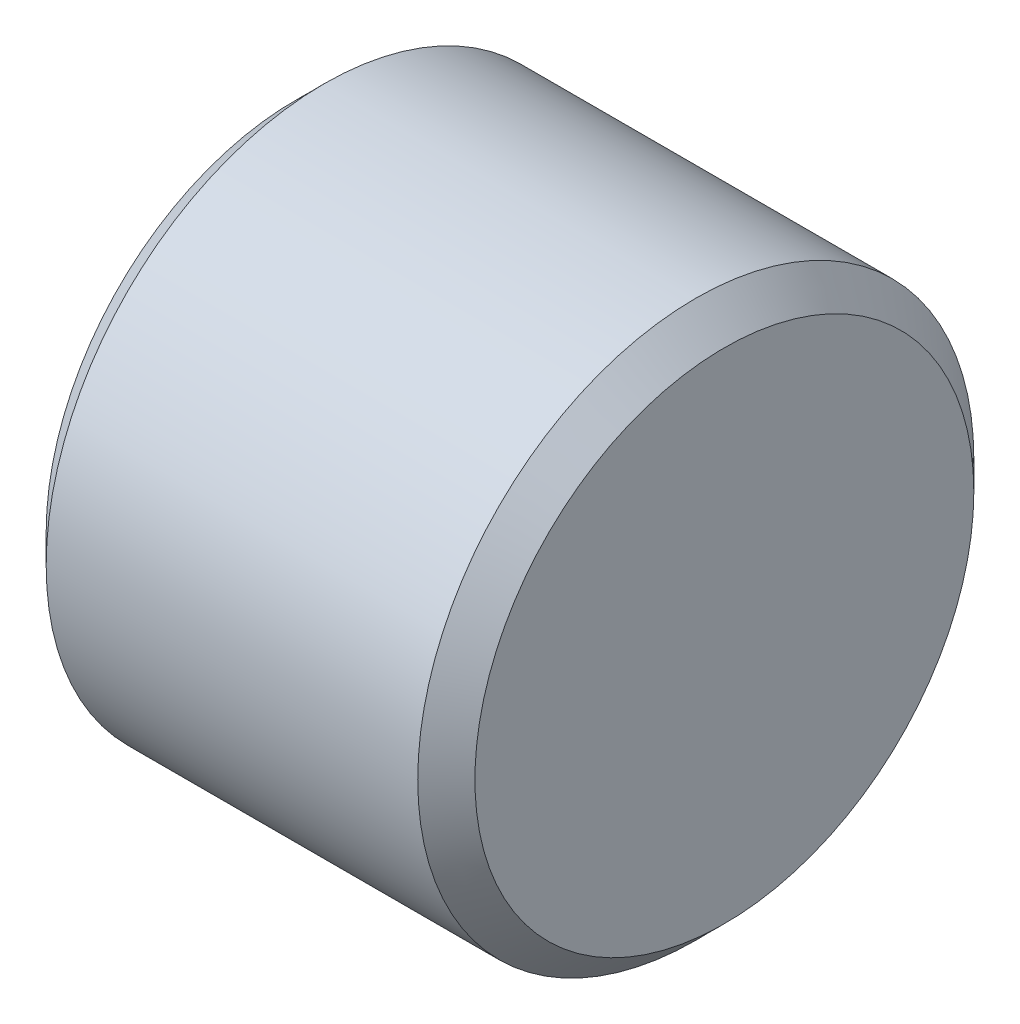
ISO-10303-21;
HEADER;
FILE_DESCRIPTION(('STEP AP214'),'2;1');
FILE_NAME('part.step','',(''),(''),'','','');
FILE_SCHEMA(('AUTOMOTIVE_DESIGN { 1 0 10303 214 1 1 1 1 }'));
ENDSEC;
DATA;
#1=APPLICATION_CONTEXT('core data for automotive mechanical design processes');
#2=APPLICATION_PROTOCOL_DEFINITION('international standard','automotive_design',2000,#1);
#3=PRODUCT_CONTEXT('',#1,'mechanical');
#4=PRODUCT('Part','Part','',(#3));
#5=PRODUCT_RELATED_PRODUCT_CATEGORY('part','',(#4));
#6=PRODUCT_DEFINITION_FORMATION('','',#4);
#7=PRODUCT_DEFINITION_CONTEXT('part definition',#1,'design');
#8=PRODUCT_DEFINITION('design','',#6,#7);
#9=PRODUCT_DEFINITION_SHAPE('','',#8);
#10=(LENGTH_UNIT() NAMED_UNIT(*) SI_UNIT(.MILLI.,.METRE.));
#11=(NAMED_UNIT(*) PLANE_ANGLE_UNIT() SI_UNIT($,.RADIAN.));
#12=(NAMED_UNIT(*) SI_UNIT($,.STERADIAN.) SOLID_ANGLE_UNIT());
#13=UNCERTAINTY_MEASURE_WITH_UNIT(LENGTH_MEASURE(1.E-05),#10,'distance_accuracy_value','');
#14=(GEOMETRIC_REPRESENTATION_CONTEXT(3) GLOBAL_UNCERTAINTY_ASSIGNED_CONTEXT((#13)) GLOBAL_UNIT_ASSIGNED_CONTEXT((#10,
#11,#12)) REPRESENTATION_CONTEXT('',''));
#15=CARTESIAN_POINT('',(0.,0.,0.));
#16=DIRECTION('',(0.,0.,1.));
#17=DIRECTION('',(1.,0.,0.));
#18=AXIS2_PLACEMENT_3D('',#15,#16,#17);
#19=CARTESIAN_POINT('',(0.,0.,0.));
#20=DIRECTION('',(1.,0.,0.));
#21=DIRECTION('',(0.,0.,-1.));
#22=AXIS2_PLACEMENT_3D('',#19,#20,#21);
#23=PLANE('',#22);
#24=CARTESIAN_POINT('',(0.,0.,0.));
#25=DIRECTION('',(1.,0.,0.));
#26=DIRECTION('',(0.,0.,-1.));
#27=AXIS2_PLACEMENT_3D('',#24,#25,#26);
#28=CIRCLE('',#27,4.364);
#29=CARTESIAN_POINT('',(0.,0.,-4.364));
#30=VERTEX_POINT('',#29);
#31=EDGE_CURVE('E60',#30,#30,#28,.T.);
#32=ORIENTED_EDGE('',*,*,#31,.T.);
#33=EDGE_LOOP('',(#32));
#34=FACE_BOUND('',#33,.T.);
#35=ADVANCED_FACE('F41',(#34),#23,.T.);
#36=CARTESIAN_POINT('',(0.,0.,0.));
#37=DIRECTION('',(1.,0.,0.));
#38=DIRECTION('',(0.,0.,-1.));
#39=AXIS2_PLACEMENT_3D('',#36,#37,#38);
#40=CYLINDRICAL_SURFACE('',#39,4.864);
#41=CARTESIAN_POINT('',(-0.500000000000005,0.,0.));
#42=DIRECTION('',(1.,0.,0.));
#43=DIRECTION('',(0.,0.,-1.));
#44=AXIS2_PLACEMENT_3D('',#41,#42,#43);
#45=CIRCLE('',#44,4.864);
#46=CARTESIAN_POINT('',(-0.500000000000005,0.,-4.864));
#47=VERTEX_POINT('',#46);
#48=EDGE_CURVE('E47',#47,#47,#45,.F.);
#49=ORIENTED_EDGE('',*,*,#48,.T.);
#50=EDGE_LOOP('',(#49));
#51=FACE_BOUND('',#50,.T.);
#52=CARTESIAN_POINT('',(-6.99999999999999,0.,0.));
#53=DIRECTION('',(-1.,0.,0.));
#54=DIRECTION('',(0.,0.,1.));
#55=AXIS2_PLACEMENT_3D('',#52,#53,#54);
#56=CIRCLE('',#55,4.864);
#57=CARTESIAN_POINT('',(-6.99999999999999,0.,4.864));
#58=VERTEX_POINT('',#57);
#59=EDGE_CURVE('E52',#58,#58,#56,.F.);
#60=ORIENTED_EDGE('',*,*,#59,.T.);
#61=EDGE_LOOP('',(#60));
#62=FACE_BOUND('',#61,.T.);
#63=ADVANCED_FACE('F80',(#51,#62),#40,.T.);
#64=CARTESIAN_POINT('',(-7.5,0.,0.));
#65=DIRECTION('',(-1.,0.,0.));
#66=DIRECTION('',(0.,0.,1.));
#67=AXIS2_PLACEMENT_3D('',#64,#65,#66);
#68=PLANE('',#67);
#69=CARTESIAN_POINT('',(-7.5,0.,0.));
#70=DIRECTION('',(-1.,0.,0.));
#71=DIRECTION('',(0.,0.,1.));
#72=AXIS2_PLACEMENT_3D('',#69,#70,#71);
#73=CIRCLE('',#72,4.36399999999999);
#74=CARTESIAN_POINT('',(-7.5,0.,4.36399999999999));
#75=VERTEX_POINT('',#74);
#76=EDGE_CURVE('E10',#75,#75,#73,.T.);
#77=ORIENTED_EDGE('',*,*,#76,.T.);
#78=EDGE_LOOP('',(#77));
#79=FACE_BOUND('',#78,.T.);
#80=CARTESIAN_POINT('',(-7.5,0.,0.0692792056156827));
#81=DIRECTION('',(-1.,0.,0.));
#82=DIRECTION('',(0.,0.,1.));
#83=AXIS2_PLACEMENT_3D('',#80,#81,#82);
#84=CIRCLE('',#83,0.6);
#85=CARTESIAN_POINT('',(-7.5,0.,0.669279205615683));
#86=VERTEX_POINT('',#85);
#87=EDGE_CURVE('E62',#86,#86,#84,.T.);
#88=ORIENTED_EDGE('',*,*,#87,.F.);
#89=EDGE_LOOP('',(#88));
#90=FACE_BOUND('',#89,.T.);
#91=ADVANCED_FACE('F74',(#79,#90),#68,.T.);
#92=CARTESIAN_POINT('',(-5.5,0.,0.0692792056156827));
#93=DIRECTION('',(-1.,0.,0.));
#94=DIRECTION('',(0.,0.,1.));
#95=AXIS2_PLACEMENT_3D('',#92,#93,#94);
#96=CYLINDRICAL_SURFACE('',#95,0.6);
#97=CARTESIAN_POINT('',(-5.5,0.,0.0692792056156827));
#98=DIRECTION('',(-1.,0.,0.));
#99=DIRECTION('',(0.,0.,1.));
#100=AXIS2_PLACEMENT_3D('',#97,#98,#99);
#101=CIRCLE('',#100,0.6);
#102=CARTESIAN_POINT('',(-5.5,0.,0.669279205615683));
#103=VERTEX_POINT('',#102);
#104=EDGE_CURVE('E64',#103,#103,#101,.T.);
#105=ORIENTED_EDGE('',*,*,#104,.F.);
#106=EDGE_LOOP('',(#105));
#107=FACE_BOUND('',#106,.T.);
#108=ORIENTED_EDGE('',*,*,#87,.T.);
#109=EDGE_LOOP('',(#108));
#110=FACE_BOUND('',#109,.T.);
#111=ADVANCED_FACE('F72',(#107,#110),#96,.F.);
#112=CARTESIAN_POINT('',(-5.5,0.,0.0692792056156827));
#113=DIRECTION('',(-1.,0.,0.));
#114=DIRECTION('',(0.,0.,1.));
#115=AXIS2_PLACEMENT_3D('',#112,#113,#114);
#116=PLANE('',#115);
#117=ORIENTED_EDGE('',*,*,#104,.T.);
#118=EDGE_LOOP('',(#117));
#119=FACE_BOUND('',#118,.T.);
#120=ADVANCED_FACE('F68',(#119),#116,.T.);
#121=CARTESIAN_POINT('',(0.,0.,0.));
#122=DIRECTION('',(-1.,0.,0.));
#123=DIRECTION('',(0.,0.,1.));
#124=AXIS2_PLACEMENT_3D('',#121,#122,#123);
#125=CONICAL_SURFACE('',#124,4.364,0.785398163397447);
#126=ORIENTED_EDGE('',*,*,#48,.F.);
#127=EDGE_LOOP('',(#126));
#128=FACE_BOUND('',#127,.T.);
#129=ORIENTED_EDGE('',*,*,#31,.F.);
#130=EDGE_LOOP('',(#129));
#131=FACE_BOUND('',#130,.T.);
#132=ADVANCED_FACE('F94',(#128,#131),#125,.T.);
#133=CARTESIAN_POINT('',(-6.99999999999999,0.,0.));
#134=DIRECTION('',(1.,0.,0.));
#135=DIRECTION('',(0.,0.,-1.));
#136=AXIS2_PLACEMENT_3D('',#133,#134,#135);
#137=CONICAL_SURFACE('',#136,4.864,0.785398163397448);
#138=ORIENTED_EDGE('',*,*,#76,.F.);
#139=EDGE_LOOP('',(#138));
#140=FACE_BOUND('',#139,.T.);
#141=ORIENTED_EDGE('',*,*,#59,.F.);
#142=EDGE_LOOP('',(#141));
#143=FACE_BOUND('',#142,.T.);
#144=ADVANCED_FACE('F42',(#140,#143),#137,.T.);
#145=CLOSED_SHELL('',(#35,#63,#91,#111,#120,#132,#144));
#146=MANIFOLD_SOLID_BREP('B2',#145);
#147=ADVANCED_BREP_SHAPE_REPRESENTATION('',(#18,#146),#14);
#148=SHAPE_DEFINITION_REPRESENTATION(#9,#147);
ENDSEC;
END-ISO-10303-21;
